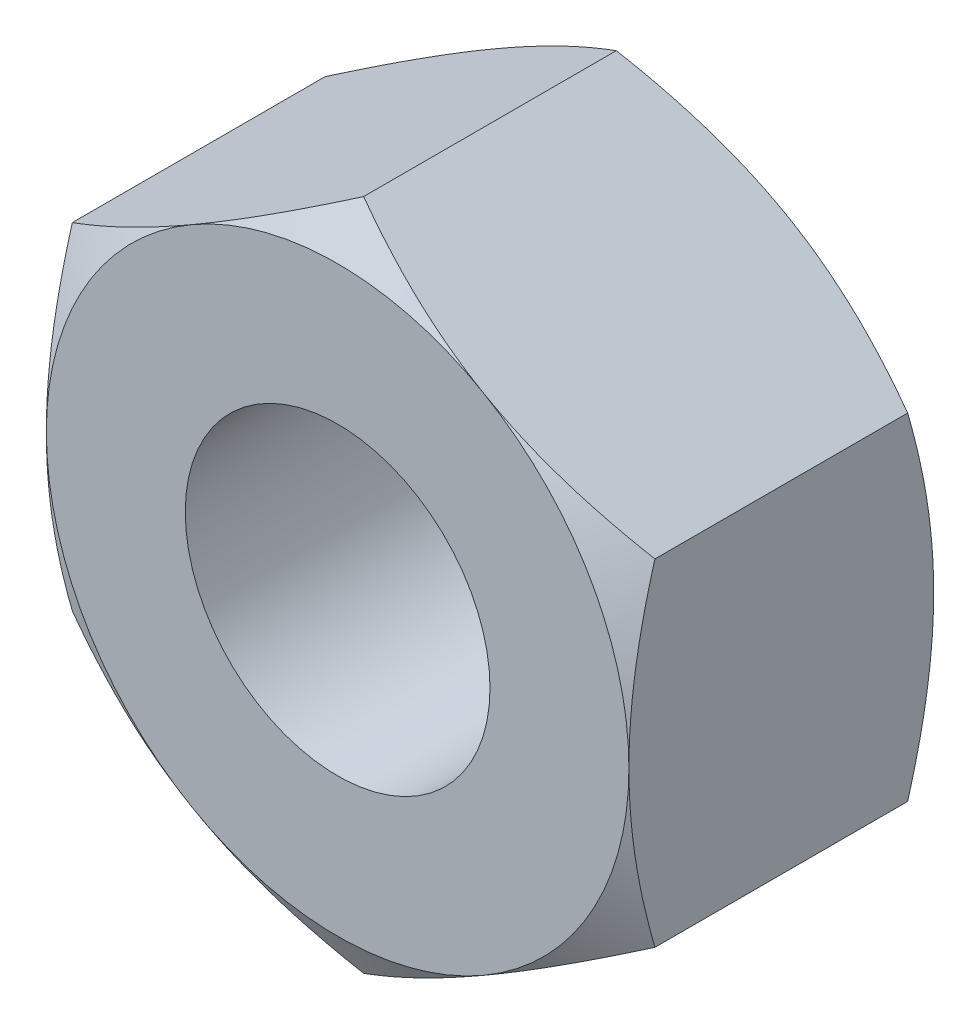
ISO-10303-21;
HEADER;
FILE_DESCRIPTION(('STEP AP214'),'2;1');
FILE_NAME('part.step','',(''),(''),'','','');
FILE_SCHEMA(('AUTOMOTIVE_DESIGN { 1 0 10303 214 1 1 1 1 }'));
ENDSEC;
DATA;
#1=APPLICATION_CONTEXT('core data for automotive mechanical design processes');
#2=APPLICATION_PROTOCOL_DEFINITION('international standard','automotive_design',2000,#1);
#3=PRODUCT_CONTEXT('',#1,'mechanical');
#4=PRODUCT('Part','Part','',(#3));
#5=PRODUCT_RELATED_PRODUCT_CATEGORY('part','',(#4));
#6=PRODUCT_DEFINITION_FORMATION('','',#4);
#7=PRODUCT_DEFINITION_CONTEXT('part definition',#1,'design');
#8=PRODUCT_DEFINITION('design','',#6,#7);
#9=PRODUCT_DEFINITION_SHAPE('','',#8);
#10=(LENGTH_UNIT() NAMED_UNIT(*) SI_UNIT(.MILLI.,.METRE.));
#11=(NAMED_UNIT(*) PLANE_ANGLE_UNIT() SI_UNIT($,.RADIAN.));
#12=(NAMED_UNIT(*) SI_UNIT($,.STERADIAN.) SOLID_ANGLE_UNIT());
#13=UNCERTAINTY_MEASURE_WITH_UNIT(LENGTH_MEASURE(1.E-05),#10,'distance_accuracy_value','');
#14=(GEOMETRIC_REPRESENTATION_CONTEXT(3) GLOBAL_UNCERTAINTY_ASSIGNED_CONTEXT((#13)) GLOBAL_UNIT_ASSIGNED_CONTEXT((#10,
#11,#12)) REPRESENTATION_CONTEXT('',''));
#15=CARTESIAN_POINT('',(0.,0.,0.));
#16=DIRECTION('',(0.,0.,1.));
#17=DIRECTION('',(1.,0.,0.));
#18=AXIS2_PLACEMENT_3D('',#15,#16,#17);
#19=CARTESIAN_POINT('',(0.,0.,-3.4));
#20=DIRECTION('',(0.,0.,1.));
#21=DIRECTION('',(1.,0.,0.));
#22=AXIS2_PLACEMENT_3D('',#19,#20,#21);
#23=PLANE('',#22);
#24=CARTESIAN_POINT('',(0.,0.,-3.4));
#25=DIRECTION('',(0.,0.,-1.));
#26=DIRECTION('',(-1.,0.,0.));
#27=AXIS2_PLACEMENT_3D('',#24,#25,#26);
#28=CIRCLE('',#27,3.4);
#29=CARTESIAN_POINT('',(-3.4,0.,-3.4));
#30=VERTEX_POINT('',#29);
#31=EDGE_CURVE('E218',#30,#30,#28,.T.);
#32=ORIENTED_EDGE('',*,*,#31,.F.);
#33=EDGE_LOOP('',(#32));
#34=FACE_BOUND('',#33,.T.);
#35=CARTESIAN_POINT('',(0.,0.,-3.4));
#36=DIRECTION('',(0.,0.,1.));
#37=DIRECTION('',(1.,0.,0.));
#38=AXIS2_PLACEMENT_3D('',#35,#36,#37);
#39=CIRCLE('',#38,6.50000000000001);
#40=CARTESIAN_POINT('',(3.25,5.62916512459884,-3.40000000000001));
#41=VERTEX_POINT('',#40);
#42=CARTESIAN_POINT('',(6.49999999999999,0.,-3.40000000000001));
#43=VERTEX_POINT('',#42);
#44=EDGE_CURVE('E43',#41,#43,#39,.F.);
#45=ORIENTED_EDGE('',*,*,#44,.T.);
#46=CARTESIAN_POINT('',(3.25,-5.62916512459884,-3.40000000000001));
#47=VERTEX_POINT('',#46);
#48=EDGE_CURVE('E11',#43,#47,#39,.F.);
#49=ORIENTED_EDGE('',*,*,#48,.T.);
#50=CARTESIAN_POINT('',(-3.24999999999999,-5.62916512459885,-3.4));
#51=VERTEX_POINT('',#50);
#52=EDGE_CURVE('E49',#47,#51,#39,.F.);
#53=ORIENTED_EDGE('',*,*,#52,.T.);
#54=CARTESIAN_POINT('',(-6.5,0.,-3.4));
#55=VERTEX_POINT('',#54);
#56=EDGE_CURVE('E133',#51,#55,#39,.F.);
#57=ORIENTED_EDGE('',*,*,#56,.T.);
#58=CARTESIAN_POINT('',(0.,0.,-3.40000000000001));
#59=DIRECTION('',(0.,0.,-1.));
#60=DIRECTION('',(-1.,0.,0.));
#61=AXIS2_PLACEMENT_3D('',#58,#59,#60);
#62=CIRCLE('',#61,6.5);
#63=CARTESIAN_POINT('',(-3.24999999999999,5.62916512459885,-3.4));
#64=VERTEX_POINT('',#63);
#65=EDGE_CURVE('E146',#55,#64,#62,.T.);
#66=ORIENTED_EDGE('',*,*,#65,.T.);
#67=EDGE_CURVE('E160',#64,#41,#39,.F.);
#68=ORIENTED_EDGE('',*,*,#67,.T.);
#69=EDGE_LOOP('',(#45,#49,#53,#57,#66,#68));
#70=FACE_BOUND('',#69,.T.);
#71=ADVANCED_FACE('F38',(#34,#70),#23,.F.);
#72=CARTESIAN_POINT('',(0.,0.,3.4));
#73=DIRECTION('',(0.,0.,1.));
#74=DIRECTION('',(1.,0.,0.));
#75=AXIS2_PLACEMENT_3D('',#72,#73,#74);
#76=PLANE('',#75);
#77=CARTESIAN_POINT('',(0.,0.,3.4));
#78=DIRECTION('',(0.,0.,-1.));
#79=DIRECTION('',(-1.,0.,0.));
#80=AXIS2_PLACEMENT_3D('',#77,#78,#79);
#81=CIRCLE('',#80,3.4);
#82=CARTESIAN_POINT('',(-3.4,0.,3.4));
#83=VERTEX_POINT('',#82);
#84=EDGE_CURVE('E294',#83,#83,#81,.T.);
#85=ORIENTED_EDGE('',*,*,#84,.T.);
#86=EDGE_LOOP('',(#85));
#87=FACE_BOUND('',#86,.T.);
#88=CARTESIAN_POINT('',(0.,0.,3.4));
#89=DIRECTION('',(0.,0.,1.));
#90=DIRECTION('',(1.,0.,0.));
#91=AXIS2_PLACEMENT_3D('',#88,#89,#90);
#92=CIRCLE('',#91,6.50000000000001);
#93=CARTESIAN_POINT('',(6.49999999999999,0.,3.40000000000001));
#94=VERTEX_POINT('',#93);
#95=CARTESIAN_POINT('',(3.25,-5.62916512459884,3.40000000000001));
#96=VERTEX_POINT('',#95);
#97=EDGE_CURVE('E325',#94,#96,#92,.F.);
#98=ORIENTED_EDGE('',*,*,#97,.F.);
#99=CARTESIAN_POINT('',(3.25,5.62916512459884,3.40000000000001));
#100=VERTEX_POINT('',#99);
#101=EDGE_CURVE('E321',#100,#94,#92,.F.);
#102=ORIENTED_EDGE('',*,*,#101,.F.);
#103=CARTESIAN_POINT('',(-3.24999999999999,5.62916512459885,3.4));
#104=VERTEX_POINT('',#103);
#105=EDGE_CURVE('E324',#104,#100,#92,.F.);
#106=ORIENTED_EDGE('',*,*,#105,.F.);
#107=CARTESIAN_POINT('',(0.,0.,3.40000000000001));
#108=DIRECTION('',(0.,0.,-1.));
#109=DIRECTION('',(-1.,0.,0.));
#110=AXIS2_PLACEMENT_3D('',#107,#108,#109);
#111=CIRCLE('',#110,6.5);
#112=CARTESIAN_POINT('',(-6.5,0.,3.4));
#113=VERTEX_POINT('',#112);
#114=EDGE_CURVE('E285',#113,#104,#111,.T.);
#115=ORIENTED_EDGE('',*,*,#114,.F.);
#116=CARTESIAN_POINT('',(-3.24999999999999,-5.62916512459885,3.4));
#117=VERTEX_POINT('',#116);
#118=EDGE_CURVE('E333',#117,#113,#92,.F.);
#119=ORIENTED_EDGE('',*,*,#118,.F.);
#120=EDGE_CURVE('E336',#96,#117,#92,.F.);
#121=ORIENTED_EDGE('',*,*,#120,.F.);
#122=EDGE_LOOP('',(#98,#102,#106,#115,#119,#121));
#123=FACE_BOUND('',#122,.T.);
#124=ADVANCED_FACE('F345',(#87,#123),#76,.T.);
#125=CARTESIAN_POINT('',(6.5,3.75277674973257,3.4));
#126=DIRECTION('',(-0.5,-0.866025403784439,0.));
#127=DIRECTION('',(0.866025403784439,-0.5,0.));
#128=AXIS2_PLACEMENT_3D('',#125,#126,#127);
#129=PLANE('',#128);
#130=DIRECTION('',(0.,0.,-1.));
#131=VECTOR('',#130,1.);
#132=CARTESIAN_POINT('',(6.5,3.75277674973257,3.4));
#133=LINE('',#132,#131);
#134=CARTESIAN_POINT('',(6.5,3.75277674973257,2.81944341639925));
#135=VERTEX_POINT('',#134);
#136=CARTESIAN_POINT('',(6.5,3.75277674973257,-2.81944341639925));
#137=VERTEX_POINT('',#136);
#138=EDGE_CURVE('E301',#135,#137,#133,.T.);
#139=ORIENTED_EDGE('',*,*,#138,.T.);
#140=CARTESIAN_POINT('',(6.5002,3.75266127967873,-2.81937674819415));
#141=CARTESIAN_POINT('',(6.35732254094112,3.8351516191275,-2.86699557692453));
#142=CARTESIAN_POINT('',(6.21391236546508,3.91794952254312,-2.91245329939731));
#143=CARTESIAN_POINT('',(5.9259273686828,4.08421773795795,-2.99845131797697));
#144=CARTESIAN_POINT('',(5.78135207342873,4.16768832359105,-3.03898949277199));
#145=CARTESIAN_POINT('',(5.34531134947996,4.41943655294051,-3.1524289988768));
#146=CARTESIAN_POINT('',(5.05212471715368,4.5887079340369,-3.21695219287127));
#147=CARTESIAN_POINT('',(4.61337625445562,4.84201947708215,-3.29261341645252));
#148=CARTESIAN_POINT('',(4.46912536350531,4.92530276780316,-3.31416714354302));
#149=CARTESIAN_POINT('',(4.17997178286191,5.09224566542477,-3.35030968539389));
#150=CARTESIAN_POINT('',(4.03506915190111,5.17590523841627,-3.36489911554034));
#151=CARTESIAN_POINT('',(3.74501222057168,5.34336968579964,-3.38674124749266));
#152=CARTESIAN_POINT('',(3.59985839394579,5.427174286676,-3.3940022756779));
#153=CARTESIAN_POINT('',(3.30942466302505,5.59485627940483,-3.40103969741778));
#154=CARTESIAN_POINT('',(3.16414476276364,5.6787336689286,-3.4008163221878));
#155=CARTESIAN_POINT('',(2.76612405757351,5.90853103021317,-3.38991654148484));
#156=CARTESIAN_POINT('',(2.51351353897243,6.05437578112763,-3.37161818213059));
#157=CARTESIAN_POINT('',(2.00997032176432,6.34509659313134,-3.31359365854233));
#158=CARTESIAN_POINT('',(1.75903939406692,6.48997163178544,-3.27384766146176));
#159=CARTESIAN_POINT('',(1.25448277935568,6.78127752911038,-3.17449409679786));
#160=CARTESIAN_POINT('',(1.00092075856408,6.92767163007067,-3.11446557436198));
#161=CARTESIAN_POINT('',(0.497578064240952,7.21827667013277,-2.97822500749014));
#162=CARTESIAN_POINT('',(0.247790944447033,7.36249133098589,-2.90204496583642));
#163=CARTESIAN_POINT('',(-0.000200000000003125,7.50566896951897,-2.81937674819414));
#164=B_SPLINE_CURVE_WITH_KNOTS('',3,(#140,#141,#142,#143,#144,#145,#146,#147,#148,#149,#150,
#151,#152,#153,#154,#155,#156,#157,#158,#159,#160,#161,#162,#163),.UNSPECIFIED.,.F.,.F.,(4,2,2,
2,2,2,2,2,2,2,2,4),(0.,0.515105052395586,1.03043143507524,2.06322554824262,2.56697389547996,
3.07067772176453,3.57380860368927,4.07692394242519,4.9527935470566,5.82947446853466,
6.72559912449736,7.61996451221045),.UNSPECIFIED.);
#165=EDGE_CURVE('E61',#137,#41,#164,.T.);
#166=ORIENTED_EDGE('',*,*,#165,.T.);
#167=CARTESIAN_POINT('',(0.,7.50555349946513,-2.81944341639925));
#168=VERTEX_POINT('',#167);
#169=EDGE_CURVE('E350',#41,#168,#164,.T.);
#170=ORIENTED_EDGE('',*,*,#169,.T.);
#171=DIRECTION('',(0.,0.,-1.));
#172=VECTOR('',#171,1.);
#173=CARTESIAN_POINT('',(0.,7.50555349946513,3.4));
#174=LINE('',#173,#172);
#175=CARTESIAN_POINT('',(0.,7.50555349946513,2.81944341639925));
#176=VERTEX_POINT('',#175);
#177=EDGE_CURVE('E319',#176,#168,#174,.T.);
#178=ORIENTED_EDGE('',*,*,#177,.F.);
#179=CARTESIAN_POINT('',(-0.000200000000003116,7.50566896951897,2.81937674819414));
#180=CARTESIAN_POINT('',(0.142677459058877,7.4231786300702,2.86699557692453));
#181=CARTESIAN_POINT('',(0.286087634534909,7.34038072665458,2.9124532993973));
#182=CARTESIAN_POINT('',(0.57407263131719,7.17411251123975,2.99845131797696));
#183=CARTESIAN_POINT('',(0.71864792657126,7.09064192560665,3.03898949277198));
#184=CARTESIAN_POINT('',(1.15468865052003,6.83889369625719,3.1524289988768));
#185=CARTESIAN_POINT('',(1.44787528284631,6.66962231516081,3.21695219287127));
#186=CARTESIAN_POINT('',(1.88662374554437,6.41631077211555,3.29261341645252));
#187=CARTESIAN_POINT('',(2.03087463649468,6.33302748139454,3.31416714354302));
#188=CARTESIAN_POINT('',(2.32002821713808,6.16608458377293,3.35030968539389));
#189=CARTESIAN_POINT('',(2.46493084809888,6.08242501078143,3.36489911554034));
#190=CARTESIAN_POINT('',(2.75498777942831,5.91496056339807,3.38674124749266));
#191=CARTESIAN_POINT('',(2.9001416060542,5.83115596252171,3.3940022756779));
#192=CARTESIAN_POINT('',(3.19057533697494,5.66347396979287,3.40103969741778));
#193=CARTESIAN_POINT('',(3.33585523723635,5.5795965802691,3.4008163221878));
#194=CARTESIAN_POINT('',(3.73387594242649,5.34979921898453,3.38991654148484));
#195=CARTESIAN_POINT('',(3.98648646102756,5.20395446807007,3.37161818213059));
#196=CARTESIAN_POINT('',(4.49002967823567,4.91323365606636,3.31359365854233));
#197=CARTESIAN_POINT('',(4.74096060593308,4.76835861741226,3.27384766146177));
#198=CARTESIAN_POINT('',(5.24551722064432,4.47705272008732,3.17449409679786));
#199=CARTESIAN_POINT('',(5.49907924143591,4.33065861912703,3.11446557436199));
#200=CARTESIAN_POINT('',(6.00242193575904,4.04005357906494,2.97822500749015));
#201=CARTESIAN_POINT('',(6.25220905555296,3.89583891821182,2.90204496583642));
#202=CARTESIAN_POINT('',(6.5002,3.75266127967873,2.81937674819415));
#203=B_SPLINE_CURVE_WITH_KNOTS('',3,(#179,#180,#181,#182,#183,#184,#185,#186,#187,#188,#189,
#190,#191,#192,#193,#194,#195,#196,#197,#198,#199,#200,#201,#202),.UNSPECIFIED.,.F.,.F.,(4,2,2,
2,2,2,2,2,2,2,2,4),(0.,0.515105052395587,1.03043143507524,2.06322554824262,2.56697389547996,
3.07067772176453,3.57380860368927,4.07692394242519,4.95279354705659,5.82947446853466,
6.72559912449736,7.61996451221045),.UNSPECIFIED.);
#204=EDGE_CURVE('E272',#176,#100,#203,.T.);
#205=ORIENTED_EDGE('',*,*,#204,.T.);
#206=EDGE_CURVE('E250',#100,#135,#203,.T.);
#207=ORIENTED_EDGE('',*,*,#206,.T.);
#208=EDGE_LOOP('',(#139,#166,#170,#178,#205,#207));
#209=FACE_BOUND('',#208,.T.);
#210=ADVANCED_FACE('F40',(#209),#129,.F.);
#211=CARTESIAN_POINT('',(0.,7.50555349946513,3.4));
#212=DIRECTION('',(0.5,-0.866025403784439,0.));
#213=DIRECTION('',(0.866025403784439,0.5,0.));
#214=AXIS2_PLACEMENT_3D('',#211,#212,#213);
#215=PLANE('',#214);
#216=ORIENTED_EDGE('',*,*,#177,.T.);
#217=CARTESIAN_POINT('',(0.000199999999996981,7.50566896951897,-2.81937674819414));
#218=CARTESIAN_POINT('',(-0.142677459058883,7.4231786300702,-2.86699557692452));
#219=CARTESIAN_POINT('',(-0.286087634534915,7.34038072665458,-2.9124532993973));
#220=CARTESIAN_POINT('',(-0.574072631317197,7.17411251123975,-2.99845131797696));
#221=CARTESIAN_POINT('',(-0.718647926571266,7.09064192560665,-3.03898949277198));
#222=CARTESIAN_POINT('',(-1.15468865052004,6.83889369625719,-3.1524289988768));
#223=CARTESIAN_POINT('',(-1.44787528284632,6.66962231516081,-3.21695219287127));
#224=CARTESIAN_POINT('',(-1.88662374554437,6.41631077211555,-3.29261341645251));
#225=CARTESIAN_POINT('',(-2.03087463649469,6.33302748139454,-3.31416714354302));
#226=CARTESIAN_POINT('',(-2.32002821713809,6.16608458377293,-3.35030968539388));
#227=CARTESIAN_POINT('',(-2.46493084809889,6.08242501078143,-3.36489911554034));
#228=CARTESIAN_POINT('',(-2.75498777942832,5.91496056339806,-3.38674124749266));
#229=CARTESIAN_POINT('',(-2.90014160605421,5.8311559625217,-3.39400227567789));
#230=CARTESIAN_POINT('',(-3.19057533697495,5.66347396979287,-3.40103969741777));
#231=CARTESIAN_POINT('',(-3.33585523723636,5.5795965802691,-3.4008163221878));
#232=CARTESIAN_POINT('',(-3.73387594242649,5.34979921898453,-3.38991654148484));
#233=CARTESIAN_POINT('',(-3.98648646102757,5.20395446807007,-3.37161818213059));
#234=CARTESIAN_POINT('',(-4.49002967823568,4.91323365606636,-3.31359365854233));
#235=CARTESIAN_POINT('',(-4.74096060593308,4.76835861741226,-3.27384766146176));
#236=CARTESIAN_POINT('',(-5.24551722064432,4.47705272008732,-3.17449409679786));
#237=CARTESIAN_POINT('',(-5.49907924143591,4.33065861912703,-3.11446557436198));
#238=CARTESIAN_POINT('',(-6.00242193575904,4.04005357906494,-2.97822500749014));
#239=CARTESIAN_POINT('',(-6.25220905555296,3.89583891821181,-2.90204496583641));
#240=CARTESIAN_POINT('',(-6.5002,3.75266127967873,-2.81937674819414));
#241=B_SPLINE_CURVE_WITH_KNOTS('',3,(#217,#218,#219,#220,#221,#222,#223,#224,#225,#226,#227,
#228,#229,#230,#231,#232,#233,#234,#235,#236,#237,#238,#239,#240),.UNSPECIFIED.,.F.,.F.,(4,2,2,
2,2,2,2,2,2,2,2,4),(0.,0.515105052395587,1.03043143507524,2.06322554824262,2.56697389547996,
3.07067772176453,3.57380860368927,4.07692394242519,4.95279354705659,5.82947446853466,
6.72559912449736,7.61996451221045),.UNSPECIFIED.);
#242=EDGE_CURVE('E170',#168,#64,#241,.T.);
#243=ORIENTED_EDGE('',*,*,#242,.T.);
#244=CARTESIAN_POINT('',(-6.5,3.75277674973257,-2.81944341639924));
#245=VERTEX_POINT('',#244);
#246=EDGE_CURVE('E149',#64,#245,#241,.T.);
#247=ORIENTED_EDGE('',*,*,#246,.T.);
#248=DIRECTION('',(0.,0.,-1.));
#249=VECTOR('',#248,1.);
#250=CARTESIAN_POINT('',(-6.5,3.75277674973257,3.4));
#251=LINE('',#250,#249);
#252=CARTESIAN_POINT('',(-6.5,3.75277674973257,2.81944341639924));
#253=VERTEX_POINT('',#252);
#254=EDGE_CURVE('E165',#253,#245,#251,.T.);
#255=ORIENTED_EDGE('',*,*,#254,.F.);
#256=CARTESIAN_POINT('',(-6.5002,3.75266127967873,2.81937674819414));
#257=CARTESIAN_POINT('',(-6.35732254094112,3.8351516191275,2.86699557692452));
#258=CARTESIAN_POINT('',(-6.21391236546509,3.91794952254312,2.9124532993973));
#259=CARTESIAN_POINT('',(-5.92592736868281,4.08421773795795,2.99845131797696));
#260=CARTESIAN_POINT('',(-5.78135207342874,4.16768832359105,3.03898949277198));
#261=CARTESIAN_POINT('',(-5.34531134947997,4.41943655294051,3.15242899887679));
#262=CARTESIAN_POINT('',(-5.05212471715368,4.58870793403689,3.21695219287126));
#263=CARTESIAN_POINT('',(-4.61337625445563,4.84201947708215,3.29261341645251));
#264=CARTESIAN_POINT('',(-4.46912536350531,4.92530276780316,3.31416714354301));
#265=CARTESIAN_POINT('',(-4.17997178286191,5.09224566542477,3.35030968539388));
#266=CARTESIAN_POINT('',(-4.03506915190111,5.17590523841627,3.36489911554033));
#267=CARTESIAN_POINT('',(-3.74501222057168,5.34336968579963,3.38674124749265));
#268=CARTESIAN_POINT('',(-3.59985839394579,5.427174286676,3.39400227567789));
#269=CARTESIAN_POINT('',(-3.30942466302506,5.59485627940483,3.40103969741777));
#270=CARTESIAN_POINT('',(-3.16414476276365,5.6787336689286,3.4008163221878));
#271=CARTESIAN_POINT('',(-2.76612405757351,5.90853103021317,3.38991654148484));
#272=CARTESIAN_POINT('',(-2.51351353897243,6.05437578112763,3.37161818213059));
#273=CARTESIAN_POINT('',(-2.00997032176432,6.34509659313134,3.31359365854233));
#274=CARTESIAN_POINT('',(-1.75903939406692,6.48997163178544,3.27384766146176));
#275=CARTESIAN_POINT('',(-1.25448277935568,6.78127752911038,3.17449409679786));
#276=CARTESIAN_POINT('',(-1.00092075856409,6.92767163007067,3.11446557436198));
#277=CARTESIAN_POINT('',(-0.497578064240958,7.21827667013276,2.97822500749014));
#278=CARTESIAN_POINT('',(-0.247790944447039,7.36249133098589,2.90204496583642));
#279=CARTESIAN_POINT('',(0.000199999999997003,7.50566896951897,2.81937674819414));
#280=B_SPLINE_CURVE_WITH_KNOTS('',3,(#256,#257,#258,#259,#260,#261,#262,#263,#264,#265,#266,
#267,#268,#269,#270,#271,#272,#273,#274,#275,#276,#277,#278,#279),.UNSPECIFIED.,.F.,.F.,(4,2,2,
2,2,2,2,2,2,2,2,4),(0.,0.515105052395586,1.03043143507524,2.06322554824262,2.56697389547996,
3.07067772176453,3.57380860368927,4.07692394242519,4.95279354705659,5.82947446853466,
6.72559912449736,7.61996451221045),.UNSPECIFIED.);
#281=EDGE_CURVE('E270',#253,#104,#280,.T.);
#282=ORIENTED_EDGE('',*,*,#281,.T.);
#283=EDGE_CURVE('E212',#104,#176,#280,.T.);
#284=ORIENTED_EDGE('',*,*,#283,.T.);
#285=EDGE_LOOP('',(#216,#243,#247,#255,#282,#284));
#286=FACE_BOUND('',#285,.T.);
#287=ADVANCED_FACE('F197',(#286),#215,.F.);
#288=CARTESIAN_POINT('',(-6.5,3.75277674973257,3.4));
#289=DIRECTION('',(1.,0.,0.));
#290=DIRECTION('',(0.,1.,0.));
#291=AXIS2_PLACEMENT_3D('',#288,#289,#290);
#292=PLANE('',#291);
#293=ORIENTED_EDGE('',*,*,#254,.T.);
#294=CARTESIAN_POINT('',(-6.49999999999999,-10.1789375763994,-0.179954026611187));
#295=CARTESIAN_POINT('',(-6.5,-9.89420569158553,-0.318467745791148));
#296=CARTESIAN_POINT('',(-6.5,-9.60883068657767,-0.455681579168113));
#297=CARTESIAN_POINT('',(-6.5,-9.03645282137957,-0.726780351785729));
#298=CARTESIAN_POINT('',(-6.5,-8.74944972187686,-0.860664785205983));
#299=CARTESIAN_POINT('',(-6.5,-8.17204195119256,-1.12502831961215));
#300=CARTESIAN_POINT('',(-6.5,-7.88162732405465,-1.25548574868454));
#301=CARTESIAN_POINT('',(-6.5,-7.29852251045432,-1.51119217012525));
#302=CARTESIAN_POINT('',(-6.5,-7.00583242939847,-1.63644140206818));
#303=CARTESIAN_POINT('',(-6.5,-6.40787719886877,-1.88443844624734));
#304=CARTESIAN_POINT('',(-6.5,-6.10251879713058,-2.00696261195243));
#305=CARTESIAN_POINT('',(-6.5,-5.48826571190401,-2.24297412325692));
#306=CARTESIAN_POINT('',(-6.5,-5.17937064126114,-2.35646046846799));
#307=CARTESIAN_POINT('',(-6.5,-4.55810105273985,-2.57148930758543));
#308=CARTESIAN_POINT('',(-6.5,-4.24573469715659,-2.67305515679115));
#309=CARTESIAN_POINT('',(-6.5,-3.61651842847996,-2.86104798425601));
#310=CARTESIAN_POINT('',(-6.5,-3.29966992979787,-2.94747962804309));
#311=CARTESIAN_POINT('',(-6.5,-2.66311232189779,-3.10065763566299));
#312=CARTESIAN_POINT('',(-6.5,-2.34343030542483,-3.1675148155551));
#313=CARTESIAN_POINT('',(-6.5,-1.69994353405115,-3.27782511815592));
#314=CARTESIAN_POINT('',(-6.5,-1.3761392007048,-3.32128061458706));
#315=CARTESIAN_POINT('',(-6.5,-0.890787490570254,-3.36603156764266));
#316=CARTESIAN_POINT('',(-6.5,-0.730142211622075,-3.37753273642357));
#317=CARTESIAN_POINT('',(-6.5,-0.408501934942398,-3.39373224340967));
#318=CARTESIAN_POINT('',(-6.5,-0.247506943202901,-3.39843069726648));
#319=CARTESIAN_POINT('',(-6.5,0.074535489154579,-3.40090495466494));
#320=CARTESIAN_POINT('',(-6.5,0.235582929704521,-3.39868076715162));
#321=CARTESIAN_POINT('',(-6.5,0.557438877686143,-3.38736734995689));
#322=CARTESIAN_POINT('',(-6.5,0.718247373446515,-3.37827779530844));
#323=CARTESIAN_POINT('',(-6.5,1.10177794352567,-3.34860619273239));
#324=CARTESIAN_POINT('',(-6.5,1.32426592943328,-3.32493007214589));
#325=CARTESIAN_POINT('',(-6.5,1.76764426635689,-3.26570479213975));
#326=CARTESIAN_POINT('',(-6.5,1.98853440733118,-3.23015409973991));
#327=CARTESIAN_POINT('',(-6.5,2.64852612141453,-3.10757058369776));
#328=CARTESIAN_POINT('',(-6.5,3.08471460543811,-3.00462690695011));
#329=CARTESIAN_POINT('',(-6.5,3.73705039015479,-2.82542929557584));
#330=CARTESIAN_POINT('',(-6.5,3.95656319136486,-2.76071599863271));
#331=CARTESIAN_POINT('',(-6.5,4.39345862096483,-2.62439535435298));
#332=CARTESIAN_POINT('',(-6.5,4.61084123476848,-2.55278795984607));
#333=CARTESIAN_POINT('',(-6.5,5.043541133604,-2.40384227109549));
#334=CARTESIAN_POINT('',(-6.5,5.25885903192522,-2.32650574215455));
#335=CARTESIAN_POINT('',(-6.5,5.68769952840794,-2.16702886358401));
#336=CARTESIAN_POINT('',(-6.5,5.90122215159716,-2.08488858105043));
#337=CARTESIAN_POINT('',(-6.5,6.41993815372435,-1.87970551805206));
#338=CARTESIAN_POINT('',(-6.5,6.72428181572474,-1.75451809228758));
#339=CARTESIAN_POINT('',(-6.5,7.33024094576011,-1.49768583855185));
#340=CARTESIAN_POINT('',(-6.5,7.6318562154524,-1.36604054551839));
#341=CARTESIAN_POINT('',(-6.5,8.2328905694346,-1.09763542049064));
#342=CARTESIAN_POINT('',(-6.5,8.53230905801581,-0.960874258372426));
#343=CARTESIAN_POINT('',(-6.5,9.12925264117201,-0.683310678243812));
#344=CARTESIAN_POINT('',(-6.5,9.42677778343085,-0.542508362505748));
#345=CARTESIAN_POINT('',(-6.5,10.0206253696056,-0.257472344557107));
#346=CARTESIAN_POINT('',(-6.5,10.3169458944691,-0.113234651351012));
#347=CARTESIAN_POINT('',(-6.5,10.908276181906,0.177905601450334));
#348=CARTESIAN_POINT('',(-6.5,11.2032859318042,0.324808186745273));
#349=CARTESIAN_POINT('',(-6.5,12.0865820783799,0.768734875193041));
#350=CARTESIAN_POINT('',(-6.5,12.673227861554,1.0690226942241));
#351=CARTESIAN_POINT('',(-6.5,13.7914174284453,1.64871031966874));
#352=CARTESIAN_POINT('',(-6.5,14.3232283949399,1.92759713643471));
#353=CARTESIAN_POINT('',(-6.5,15.384885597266,2.48913587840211));
#354=CARTESIAN_POINT('',(-6.5,15.9147317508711,2.77178795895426));
#355=CARTESIAN_POINT('',(-6.5,16.9714418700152,3.33915853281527));
#356=CARTESIAN_POINT('',(-6.50000000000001,17.4983100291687,3.6238692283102));
#357=CARTESIAN_POINT('',(-6.50000000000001,18.5507985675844,4.19551215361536));
#358=CARTESIAN_POINT('',(-6.50000000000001,19.0764190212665,4.48244424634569));
#359=CARTESIAN_POINT('',(-6.50000000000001,19.6015850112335,4.77020015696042));
#360=B_SPLINE_CURVE_WITH_KNOTS('',3,(#294,#295,#296,#297,#298,#299,#300,#301,#302,#303,#304,
#305,#306,#307,#308,#309,#310,#311,#312,#313,#314,#315,#316,#317,#318,#319,#320,#321,#322,#323,
#324,#325,#326,#327,#328,#329,#330,#331,#332,#333,#334,#335,#336,#337,#338,#339,#340,#341,#342,
#343,#344,#345,#346,#347,#348,#349,#350,#351,#352,#353,#354,#355,#356,#357,#358,#359),
.UNSPECIFIED.,.F.,.F.,(4,2,2,2,2,2,2,2,2,2,2,2,2,2,2,2,2,2,2,2,2,2,2,2,2,2,2,2,2,2,2,2,4),(0.,
0.949918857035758,1.89998115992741,2.85505176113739,3.8100783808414,4.79703592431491,
5.78410256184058,6.76920180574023,7.753996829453,8.73310381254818,9.71211146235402,
10.1951587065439,10.6781977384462,11.1612361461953,11.6442974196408,12.3151530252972,
12.9860952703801,14.3286824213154,15.0151814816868,15.7016852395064,16.3879783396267,
17.0742618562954,18.0614141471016,19.0486376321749,20.0361196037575,21.0235766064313,
22.0122428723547,23.0009186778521,24.9779620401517,26.7794473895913,28.581007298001,
30.3776240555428,32.1741308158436),.UNSPECIFIED.);
#361=EDGE_CURVE('E142',#245,#55,#360,.F.);
#362=ORIENTED_EDGE('',*,*,#361,.T.);
#363=CARTESIAN_POINT('',(-6.5,-3.75277674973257,-2.81944341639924));
#364=VERTEX_POINT('',#363);
#365=EDGE_CURVE('E129',#55,#364,#360,.F.);
#366=ORIENTED_EDGE('',*,*,#365,.T.);
#367=DIRECTION('',(0.,0.,-1.));
#368=VECTOR('',#367,1.);
#369=CARTESIAN_POINT('',(-6.5,-3.75277674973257,3.4));
#370=LINE('',#369,#368);
#371=CARTESIAN_POINT('',(-6.5,-3.75277674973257,2.81944341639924));
#372=VERTEX_POINT('',#371);
#373=EDGE_CURVE('E288',#372,#364,#370,.T.);
#374=ORIENTED_EDGE('',*,*,#373,.F.);
#375=CARTESIAN_POINT('',(-6.49999999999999,-10.1789375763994,0.179954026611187));
#376=CARTESIAN_POINT('',(-6.5,-9.89420569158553,0.318467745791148));
#377=CARTESIAN_POINT('',(-6.5,-9.60883068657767,0.455681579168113));
#378=CARTESIAN_POINT('',(-6.5,-9.03645282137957,0.726780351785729));
#379=CARTESIAN_POINT('',(-6.5,-8.74944972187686,0.860664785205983));
#380=CARTESIAN_POINT('',(-6.5,-8.17204195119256,1.12502831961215));
#381=CARTESIAN_POINT('',(-6.5,-7.88162732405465,1.25548574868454));
#382=CARTESIAN_POINT('',(-6.5,-7.29852251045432,1.51119217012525));
#383=CARTESIAN_POINT('',(-6.5,-7.00583242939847,1.63644140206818));
#384=CARTESIAN_POINT('',(-6.5,-6.40787719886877,1.88443844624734));
#385=CARTESIAN_POINT('',(-6.5,-6.10251879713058,2.00696261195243));
#386=CARTESIAN_POINT('',(-6.5,-5.48826571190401,2.24297412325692));
#387=CARTESIAN_POINT('',(-6.5,-5.17937064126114,2.35646046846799));
#388=CARTESIAN_POINT('',(-6.5,-4.55810105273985,2.57148930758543));
#389=CARTESIAN_POINT('',(-6.5,-4.24573469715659,2.67305515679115));
#390=CARTESIAN_POINT('',(-6.5,-3.61651842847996,2.86104798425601));
#391=CARTESIAN_POINT('',(-6.5,-3.29966992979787,2.94747962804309));
#392=CARTESIAN_POINT('',(-6.5,-2.66311232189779,3.10065763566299));
#393=CARTESIAN_POINT('',(-6.5,-2.34343030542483,3.1675148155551));
#394=CARTESIAN_POINT('',(-6.5,-1.69994353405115,3.27782511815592));
#395=CARTESIAN_POINT('',(-6.5,-1.3761392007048,3.32128061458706));
#396=CARTESIAN_POINT('',(-6.5,-0.890787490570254,3.36603156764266));
#397=CARTESIAN_POINT('',(-6.5,-0.730142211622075,3.37753273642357));
#398=CARTESIAN_POINT('',(-6.5,-0.408501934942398,3.39373224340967));
#399=CARTESIAN_POINT('',(-6.5,-0.247506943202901,3.39843069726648));
#400=CARTESIAN_POINT('',(-6.5,0.074535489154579,3.40090495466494));
#401=CARTESIAN_POINT('',(-6.5,0.235582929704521,3.39868076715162));
#402=CARTESIAN_POINT('',(-6.5,0.557438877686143,3.38736734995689));
#403=CARTESIAN_POINT('',(-6.5,0.718247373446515,3.37827779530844));
#404=CARTESIAN_POINT('',(-6.5,1.10177794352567,3.34860619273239));
#405=CARTESIAN_POINT('',(-6.5,1.32426592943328,3.32493007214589));
#406=CARTESIAN_POINT('',(-6.5,1.76764426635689,3.26570479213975));
#407=CARTESIAN_POINT('',(-6.5,1.98853440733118,3.23015409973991));
#408=CARTESIAN_POINT('',(-6.5,2.64852612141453,3.10757058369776));
#409=CARTESIAN_POINT('',(-6.5,3.08471460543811,3.00462690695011));
#410=CARTESIAN_POINT('',(-6.5,3.73705039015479,2.82542929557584));
#411=CARTESIAN_POINT('',(-6.5,3.95656319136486,2.76071599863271));
#412=CARTESIAN_POINT('',(-6.5,4.39345862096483,2.62439535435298));
#413=CARTESIAN_POINT('',(-6.5,4.61084123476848,2.55278795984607));
#414=CARTESIAN_POINT('',(-6.5,5.043541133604,2.40384227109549));
#415=CARTESIAN_POINT('',(-6.5,5.25885903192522,2.32650574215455));
#416=CARTESIAN_POINT('',(-6.5,5.68769952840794,2.16702886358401));
#417=CARTESIAN_POINT('',(-6.5,5.90122215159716,2.08488858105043));
#418=CARTESIAN_POINT('',(-6.5,6.41993815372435,1.87970551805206));
#419=CARTESIAN_POINT('',(-6.5,6.72428181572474,1.75451809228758));
#420=CARTESIAN_POINT('',(-6.5,7.33024094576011,1.49768583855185));
#421=CARTESIAN_POINT('',(-6.5,7.6318562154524,1.36604054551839));
#422=CARTESIAN_POINT('',(-6.5,8.2328905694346,1.09763542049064));
#423=CARTESIAN_POINT('',(-6.5,8.53230905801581,0.960874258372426));
#424=CARTESIAN_POINT('',(-6.5,9.12925264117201,0.683310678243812));
#425=CARTESIAN_POINT('',(-6.5,9.42677778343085,0.542508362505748));
#426=CARTESIAN_POINT('',(-6.5,10.0206253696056,0.257472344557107));
#427=CARTESIAN_POINT('',(-6.5,10.3169458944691,0.113234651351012));
#428=CARTESIAN_POINT('',(-6.5,10.908276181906,-0.177905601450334));
#429=CARTESIAN_POINT('',(-6.5,11.2032859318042,-0.324808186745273));
#430=CARTESIAN_POINT('',(-6.5,12.0865820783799,-0.768734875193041));
#431=CARTESIAN_POINT('',(-6.5,12.673227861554,-1.0690226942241));
#432=CARTESIAN_POINT('',(-6.5,13.7914174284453,-1.64871031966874));
#433=CARTESIAN_POINT('',(-6.5,14.3232283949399,-1.92759713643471));
#434=CARTESIAN_POINT('',(-6.5,15.384885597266,-2.48913587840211));
#435=CARTESIAN_POINT('',(-6.5,15.9147317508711,-2.77178795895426));
#436=CARTESIAN_POINT('',(-6.5,16.9714418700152,-3.33915853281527));
#437=CARTESIAN_POINT('',(-6.50000000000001,17.4983100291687,-3.6238692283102));
#438=CARTESIAN_POINT('',(-6.50000000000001,18.5507985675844,-4.19551215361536));
#439=CARTESIAN_POINT('',(-6.50000000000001,19.0764190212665,-4.48244424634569));
#440=CARTESIAN_POINT('',(-6.50000000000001,19.6015850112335,-4.77020015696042));
#441=B_SPLINE_CURVE_WITH_KNOTS('',3,(#375,#376,#377,#378,#379,#380,#381,#382,#383,#384,#385,
#386,#387,#388,#389,#390,#391,#392,#393,#394,#395,#396,#397,#398,#399,#400,#401,#402,#403,#404,
#405,#406,#407,#408,#409,#410,#411,#412,#413,#414,#415,#416,#417,#418,#419,#420,#421,#422,#423,
#424,#425,#426,#427,#428,#429,#430,#431,#432,#433,#434,#435,#436,#437,#438,#439,#440),
.UNSPECIFIED.,.F.,.F.,(4,2,2,2,2,2,2,2,2,2,2,2,2,2,2,2,2,2,2,2,2,2,2,2,2,2,2,2,2,2,2,2,4),(0.,
0.949918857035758,1.89998115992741,2.85505176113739,3.8100783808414,4.79703592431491,
5.78410256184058,6.76920180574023,7.753996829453,8.73310381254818,9.71211146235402,
10.1951587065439,10.6781977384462,11.1612361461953,11.6442974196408,12.3151530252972,
12.9860952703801,14.3286824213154,15.0151814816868,15.7016852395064,16.3879783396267,
17.0742618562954,18.0614141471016,19.0486376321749,20.0361196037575,21.0235766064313,
22.0122428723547,23.0009186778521,24.9779620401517,26.7794473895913,28.581007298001,
30.3776240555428,32.1741308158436),.UNSPECIFIED.);
#442=EDGE_CURVE('E210',#372,#113,#441,.T.);
#443=ORIENTED_EDGE('',*,*,#442,.T.);
#444=EDGE_CURVE('E203',#113,#253,#441,.T.);
#445=ORIENTED_EDGE('',*,*,#444,.T.);
#446=EDGE_LOOP('',(#293,#362,#366,#374,#443,#445));
#447=FACE_BOUND('',#446,.T.);
#448=ADVANCED_FACE('F162',(#447),#292,.F.);
#449=CARTESIAN_POINT('',(-6.5,-3.75277674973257,3.4));
#450=DIRECTION('',(0.5,0.866025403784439,0.));
#451=DIRECTION('',(-0.866025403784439,0.5,0.));
#452=AXIS2_PLACEMENT_3D('',#449,#450,#451);
#453=PLANE('',#452);
#454=ORIENTED_EDGE('',*,*,#373,.T.);
#455=CARTESIAN_POINT('',(-6.5002,-3.75266127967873,-2.81937674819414));
#456=CARTESIAN_POINT('',(-6.35732254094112,-3.83515161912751,-2.86699557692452));
#457=CARTESIAN_POINT('',(-6.21391236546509,-3.91794952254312,-2.9124532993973));
#458=CARTESIAN_POINT('',(-5.9259273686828,-4.08421773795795,-2.99845131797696));
#459=CARTESIAN_POINT('',(-5.78135207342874,-4.16768832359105,-3.03898949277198));
#460=CARTESIAN_POINT('',(-5.34531134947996,-4.41943655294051,-3.1524289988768));
#461=CARTESIAN_POINT('',(-5.05212471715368,-4.58870793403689,-3.21695219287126));
#462=CARTESIAN_POINT('',(-4.61337625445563,-4.84201947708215,-3.29261341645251));
#463=CARTESIAN_POINT('',(-4.46912536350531,-4.92530276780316,-3.31416714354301));
#464=CARTESIAN_POINT('',(-4.17997178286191,-5.09224566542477,-3.35030968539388));
#465=CARTESIAN_POINT('',(-4.03506915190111,-5.17590523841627,-3.36489911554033));
#466=CARTESIAN_POINT('',(-3.74501222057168,-5.34336968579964,-3.38674124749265));
#467=CARTESIAN_POINT('',(-3.59985839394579,-5.427174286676,-3.39400227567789));
#468=CARTESIAN_POINT('',(-3.30942466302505,-5.59485627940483,-3.40103969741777));
#469=CARTESIAN_POINT('',(-3.16414476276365,-5.6787336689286,-3.4008163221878));
#470=CARTESIAN_POINT('',(-2.76612405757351,-5.90853103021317,-3.38991654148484));
#471=CARTESIAN_POINT('',(-2.51351353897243,-6.05437578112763,-3.37161818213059));
#472=CARTESIAN_POINT('',(-2.00997032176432,-6.34509659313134,-3.31359365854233));
#473=CARTESIAN_POINT('',(-1.75903939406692,-6.48997163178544,-3.27384766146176));
#474=CARTESIAN_POINT('',(-1.25448277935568,-6.78127752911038,-3.17449409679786));
#475=CARTESIAN_POINT('',(-1.00092075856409,-6.92767163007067,-3.11446557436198));
#476=CARTESIAN_POINT('',(-0.497578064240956,-7.21827667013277,-2.97822500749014));
#477=CARTESIAN_POINT('',(-0.247790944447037,-7.36249133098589,-2.90204496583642));
#478=CARTESIAN_POINT('',(0.000200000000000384,-7.50566896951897,-2.81937674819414));
#479=B_SPLINE_CURVE_WITH_KNOTS('',3,(#455,#456,#457,#458,#459,#460,#461,#462,#463,#464,#465,
#466,#467,#468,#469,#470,#471,#472,#473,#474,#475,#476,#477,#478),.UNSPECIFIED.,.F.,.F.,(4,2,2,
2,2,2,2,2,2,2,2,4),(0.,0.515105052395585,1.03043143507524,2.06322554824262,2.56697389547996,
3.07067772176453,3.57380860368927,4.07692394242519,4.95279354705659,5.82947446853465,
6.72559912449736,7.61996451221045),.UNSPECIFIED.);
#480=EDGE_CURVE('E136',#364,#51,#479,.T.);
#481=ORIENTED_EDGE('',*,*,#480,.T.);
#482=CARTESIAN_POINT('',(0.,-7.50555349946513,-2.81944341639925));
#483=VERTEX_POINT('',#482);
#484=EDGE_CURVE('E179',#51,#483,#479,.T.);
#485=ORIENTED_EDGE('',*,*,#484,.T.);
#486=DIRECTION('',(0.,0.,-1.));
#487=VECTOR('',#486,1.);
#488=CARTESIAN_POINT('',(0.,-7.50555349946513,3.4));
#489=LINE('',#488,#487);
#490=CARTESIAN_POINT('',(0.,-7.50555349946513,2.81944341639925));
#491=VERTEX_POINT('',#490);
#492=EDGE_CURVE('E313',#491,#483,#489,.T.);
#493=ORIENTED_EDGE('',*,*,#492,.F.);
#494=CARTESIAN_POINT('',(0.000200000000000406,-7.50566896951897,2.81937674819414));
#495=CARTESIAN_POINT('',(-0.14267745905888,-7.4231786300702,2.86699557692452));
#496=CARTESIAN_POINT('',(-0.286087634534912,-7.34038072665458,2.9124532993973));
#497=CARTESIAN_POINT('',(-0.574072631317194,-7.17411251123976,2.99845131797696));
#498=CARTESIAN_POINT('',(-0.718647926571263,-7.09064192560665,3.03898949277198));
#499=CARTESIAN_POINT('',(-1.15468865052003,-6.83889369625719,3.1524289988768));
#500=CARTESIAN_POINT('',(-1.44787528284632,-6.66962231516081,3.21695219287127));
#501=CARTESIAN_POINT('',(-1.88662374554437,-6.41631077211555,3.29261341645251));
#502=CARTESIAN_POINT('',(-2.03087463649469,-6.33302748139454,3.31416714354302));
#503=CARTESIAN_POINT('',(-2.32002821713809,-6.16608458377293,3.35030968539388));
#504=CARTESIAN_POINT('',(-2.46493084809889,-6.08242501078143,3.36489911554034));
#505=CARTESIAN_POINT('',(-2.75498777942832,-5.91496056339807,3.38674124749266));
#506=CARTESIAN_POINT('',(-2.90014160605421,-5.8311559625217,3.39400227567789));
#507=CARTESIAN_POINT('',(-3.19057533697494,-5.66347396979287,3.40103969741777));
#508=CARTESIAN_POINT('',(-3.33585523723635,-5.5795965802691,3.4008163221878));
#509=CARTESIAN_POINT('',(-3.73387594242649,-5.34979921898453,3.38991654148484));
#510=CARTESIAN_POINT('',(-3.98648646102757,-5.20395446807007,3.37161818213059));
#511=CARTESIAN_POINT('',(-4.49002967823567,-4.91323365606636,3.31359365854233));
#512=CARTESIAN_POINT('',(-4.74096060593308,-4.76835861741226,3.27384766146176));
#513=CARTESIAN_POINT('',(-5.24551722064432,-4.47705272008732,3.17449409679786));
#514=CARTESIAN_POINT('',(-5.49907924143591,-4.33065861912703,3.11446557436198));
#515=CARTESIAN_POINT('',(-6.00242193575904,-4.04005357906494,2.97822500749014));
#516=CARTESIAN_POINT('',(-6.25220905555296,-3.89583891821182,2.90204496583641));
#517=CARTESIAN_POINT('',(-6.5002,-3.75266127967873,2.81937674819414));
#518=B_SPLINE_CURVE_WITH_KNOTS('',3,(#494,#495,#496,#497,#498,#499,#500,#501,#502,#503,#504,
#505,#506,#507,#508,#509,#510,#511,#512,#513,#514,#515,#516,#517),.UNSPECIFIED.,.F.,.F.,(4,2,2,
2,2,2,2,2,2,2,2,4),(0.,0.515105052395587,1.03043143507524,2.06322554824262,2.56697389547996,
3.07067772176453,3.57380860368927,4.07692394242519,4.95279354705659,5.82947446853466,
6.72559912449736,7.61996451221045),.UNSPECIFIED.);
#519=EDGE_CURVE('E255',#491,#117,#518,.T.);
#520=ORIENTED_EDGE('',*,*,#519,.T.);
#521=EDGE_CURVE('E211',#117,#372,#518,.T.);
#522=ORIENTED_EDGE('',*,*,#521,.T.);
#523=EDGE_LOOP('',(#454,#481,#485,#493,#520,#522));
#524=FACE_BOUND('',#523,.T.);
#525=ADVANCED_FACE('F196',(#524),#453,.F.);
#526=CARTESIAN_POINT('',(0.,-7.50555349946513,3.4));
#527=DIRECTION('',(-0.5,0.866025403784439,0.));
#528=DIRECTION('',(-0.866025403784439,-0.5,0.));
#529=AXIS2_PLACEMENT_3D('',#526,#527,#528);
#530=PLANE('',#529);
#531=ORIENTED_EDGE('',*,*,#492,.T.);
#532=CARTESIAN_POINT('',(-0.000199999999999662,-7.50566896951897,-2.81937674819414));
#533=CARTESIAN_POINT('',(0.14267745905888,-7.4231786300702,-2.86699557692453));
#534=CARTESIAN_POINT('',(0.286087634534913,-7.34038072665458,-2.9124532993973));
#535=CARTESIAN_POINT('',(0.574072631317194,-7.17411251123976,-2.99845131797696));
#536=CARTESIAN_POINT('',(0.718647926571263,-7.09064192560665,-3.03898949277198));
#537=CARTESIAN_POINT('',(1.15468865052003,-6.83889369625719,-3.1524289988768));
#538=CARTESIAN_POINT('',(1.44787528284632,-6.66962231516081,-3.21695219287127));
#539=CARTESIAN_POINT('',(1.88662374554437,-6.41631077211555,-3.29261341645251));
#540=CARTESIAN_POINT('',(2.03087463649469,-6.33302748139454,-3.31416714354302));
#541=CARTESIAN_POINT('',(2.32002821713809,-6.16608458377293,-3.35030968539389));
#542=CARTESIAN_POINT('',(2.46493084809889,-6.08242501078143,-3.36489911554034));
#543=CARTESIAN_POINT('',(2.75498777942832,-5.91496056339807,-3.38674124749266));
#544=CARTESIAN_POINT('',(2.90014160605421,-5.8311559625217,-3.3940022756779));
#545=CARTESIAN_POINT('',(3.19057533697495,-5.66347396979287,-3.40103969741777));
#546=CARTESIAN_POINT('',(3.33585523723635,-5.5795965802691,-3.4008163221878));
#547=CARTESIAN_POINT('',(3.73387594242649,-5.34979921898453,-3.38991654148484));
#548=CARTESIAN_POINT('',(3.98648646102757,-5.20395446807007,-3.37161818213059));
#549=CARTESIAN_POINT('',(4.49002967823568,-4.91323365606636,-3.31359365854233));
#550=CARTESIAN_POINT('',(4.74096060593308,-4.76835861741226,-3.27384766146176));
#551=CARTESIAN_POINT('',(5.24551722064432,-4.47705272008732,-3.17449409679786));
#552=CARTESIAN_POINT('',(5.49907924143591,-4.33065861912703,-3.11446557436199));
#553=CARTESIAN_POINT('',(6.00242193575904,-4.04005357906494,-2.97822500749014));
#554=CARTESIAN_POINT('',(6.25220905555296,-3.89583891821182,-2.90204496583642));
#555=CARTESIAN_POINT('',(6.5002,-3.75266127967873,-2.81937674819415));
#556=B_SPLINE_CURVE_WITH_KNOTS('',3,(#532,#533,#534,#535,#536,#537,#538,#539,#540,#541,#542,
#543,#544,#545,#546,#547,#548,#549,#550,#551,#552,#553,#554,#555),.UNSPECIFIED.,.F.,.F.,(4,2,2,
2,2,2,2,2,2,2,2,4),(0.,0.515105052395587,1.03043143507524,2.06322554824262,2.56697389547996,
3.07067772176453,3.57380860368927,4.07692394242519,4.9527935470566,5.82947446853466,
6.72559912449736,7.61996451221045),.UNSPECIFIED.);
#557=EDGE_CURVE('E408',#483,#47,#556,.T.);
#558=ORIENTED_EDGE('',*,*,#557,.T.);
#559=CARTESIAN_POINT('',(6.5,-3.75277674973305,-2.81944341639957));
#560=VERTEX_POINT('',#559);
#561=EDGE_CURVE('E401',#47,#560,#556,.T.);
#562=ORIENTED_EDGE('',*,*,#561,.T.);
#563=DIRECTION('',(0.,0.,-1.));
#564=VECTOR('',#563,1.);
#565=CARTESIAN_POINT('',(6.5,-3.75277674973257,3.4));
#566=LINE('',#565,#564);
#567=CARTESIAN_POINT('',(6.5,-3.75277674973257,2.81944341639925));
#568=VERTEX_POINT('',#567);
#569=EDGE_CURVE('E307',#568,#560,#566,.T.);
#570=ORIENTED_EDGE('',*,*,#569,.F.);
#571=CARTESIAN_POINT('',(6.5002,-3.75266127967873,2.81937674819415));
#572=CARTESIAN_POINT('',(6.35732254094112,-3.8351516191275,2.86699557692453));
#573=CARTESIAN_POINT('',(6.21391236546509,-3.91794952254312,2.91245329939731));
#574=CARTESIAN_POINT('',(5.92592736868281,-4.08421773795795,2.99845131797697));
#575=CARTESIAN_POINT('',(5.78135207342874,-4.16768832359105,3.03898949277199));
#576=CARTESIAN_POINT('',(5.34531134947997,-4.41943655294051,3.1524289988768));
#577=CARTESIAN_POINT('',(5.05212471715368,-4.58870793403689,3.21695219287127));
#578=CARTESIAN_POINT('',(4.61337625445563,-4.84201947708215,3.29261341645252));
#579=CARTESIAN_POINT('',(4.46912536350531,-4.92530276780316,3.31416714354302));
#580=CARTESIAN_POINT('',(4.17997178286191,-5.09224566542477,3.35030968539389));
#581=CARTESIAN_POINT('',(4.03506915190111,-5.17590523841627,3.36489911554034));
#582=CARTESIAN_POINT('',(3.74501222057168,-5.34336968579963,3.38674124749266));
#583=CARTESIAN_POINT('',(3.59985839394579,-5.427174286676,3.3940022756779));
#584=CARTESIAN_POINT('',(3.30942466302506,-5.59485627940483,3.40103969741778));
#585=CARTESIAN_POINT('',(3.16414476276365,-5.6787336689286,3.4008163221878));
#586=CARTESIAN_POINT('',(2.76612405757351,-5.90853103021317,3.38991654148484));
#587=CARTESIAN_POINT('',(2.51351353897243,-6.05437578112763,3.37161818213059));
#588=CARTESIAN_POINT('',(2.00997032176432,-6.34509659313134,3.31359365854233));
#589=CARTESIAN_POINT('',(1.75903939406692,-6.48997163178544,3.27384766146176));
#590=CARTESIAN_POINT('',(1.25448277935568,-6.78127752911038,3.17449409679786));
#591=CARTESIAN_POINT('',(1.00092075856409,-6.92767163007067,3.11446557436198));
#592=CARTESIAN_POINT('',(0.497578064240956,-7.21827667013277,2.97822500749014));
#593=CARTESIAN_POINT('',(0.247790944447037,-7.36249133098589,2.90204496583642));
#594=CARTESIAN_POINT('',(-0.000199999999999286,-7.50566896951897,2.81937674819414));
#595=B_SPLINE_CURVE_WITH_KNOTS('',3,(#571,#572,#573,#574,#575,#576,#577,#578,#579,#580,#581,
#582,#583,#584,#585,#586,#587,#588,#589,#590,#591,#592,#593,#594),.UNSPECIFIED.,.F.,.F.,(4,2,2,
2,2,2,2,2,2,2,2,4),(0.,0.515105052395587,1.03043143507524,2.06322554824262,2.56697389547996,
3.07067772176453,3.57380860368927,4.07692394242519,4.9527935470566,5.82947446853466,
6.72559912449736,7.61996451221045),.UNSPECIFIED.);
#596=EDGE_CURVE('E243',#568,#96,#595,.T.);
#597=ORIENTED_EDGE('',*,*,#596,.T.);
#598=EDGE_CURVE('E262',#96,#491,#595,.T.);
#599=ORIENTED_EDGE('',*,*,#598,.T.);
#600=EDGE_LOOP('',(#531,#558,#562,#570,#597,#599));
#601=FACE_BOUND('',#600,.T.);
#602=ADVANCED_FACE('F392',(#601),#530,.F.);
#603=CARTESIAN_POINT('',(6.5,-3.75277674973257,3.4));
#604=DIRECTION('',(-1.,0.,0.));
#605=DIRECTION('',(0.,-1.,0.));
#606=AXIS2_PLACEMENT_3D('',#603,#604,#605);
#607=PLANE('',#606);
#608=ORIENTED_EDGE('',*,*,#569,.T.);
#609=CARTESIAN_POINT('',(6.5,-10.1789375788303,-0.179954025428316));
#610=CARTESIAN_POINT('',(6.5,-9.8942056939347,-0.318467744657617));
#611=CARTESIAN_POINT('',(6.5,-9.60883068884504,-0.455681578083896));
#612=CARTESIAN_POINT('',(6.5,-9.0364528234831,-0.726780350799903));
#613=CARTESIAN_POINT('',(6.5,-8.74944972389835,-0.860664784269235));
#614=CARTESIAN_POINT('',(6.5,-8.1720419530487,-1.12502831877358));
#615=CARTESIAN_POINT('',(6.5,-7.88162732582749,-1.25548574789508));
#616=CARTESIAN_POINT('',(6.5,-7.29852251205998,-1.51119216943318));
#617=CARTESIAN_POINT('',(6.5,-7.00583243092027,-1.6364414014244));
#618=CARTESIAN_POINT('',(6.5,-6.40787720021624,-1.88443844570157));
#619=CARTESIAN_POINT('',(6.5,-6.10251879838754,-2.00696261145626));
#620=CARTESIAN_POINT('',(6.5,-5.48826571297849,-2.24297412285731));
#621=CARTESIAN_POINT('',(6.5,-5.17937064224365,-2.35646046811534));
#622=CARTESIAN_POINT('',(6.5,-4.55810105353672,-2.57148930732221));
#623=CARTESIAN_POINT('',(6.5,-4.24573469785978,-2.67305515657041));
#624=CARTESIAN_POINT('',(6.5,-3.61651842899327,-2.8610479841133));
#625=CARTESIAN_POINT('',(6.5,-3.29966993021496,-2.94747962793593));
#626=CARTESIAN_POINT('',(6.5,-2.66311232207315,-3.10065763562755));
#627=CARTESIAN_POINT('',(6.5,-2.343430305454,-3.1675148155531));
#628=CARTESIAN_POINT('',(6.5,-1.69994353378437,-3.27782511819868));
#629=CARTESIAN_POINT('',(6.5,-1.37613920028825,-3.32128061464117));
#630=CARTESIAN_POINT('',(6.5,-0.890787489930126,-3.36603156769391));
#631=CARTESIAN_POINT('',(6.5,-0.730142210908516,-3.37753273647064));
#632=CARTESIAN_POINT('',(6.5,-0.408501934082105,-3.3937322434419));
#633=CARTESIAN_POINT('',(6.5,-0.247506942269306,-3.39843069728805));
#634=CARTESIAN_POINT('',(6.5,0.0745354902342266,-3.40090495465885));
#635=CARTESIAN_POINT('',(6.5,0.235582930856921,-3.39868076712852));
#636=CARTESIAN_POINT('',(6.5,0.557438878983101,-3.38736734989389));
#637=CARTESIAN_POINT('',(6.5,0.718247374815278,-3.37827779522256));
#638=CARTESIAN_POINT('',(6.5,1.10177794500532,-3.34860619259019));
#639=CARTESIAN_POINT('',(6.5,1.3242659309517,-3.32493007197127));
#640=CARTESIAN_POINT('',(6.5,1.76764426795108,-3.26570479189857));
#641=CARTESIAN_POINT('',(6.5,1.98853440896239,-3.23015409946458));
#642=CARTESIAN_POINT('',(6.5,2.64852612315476,-3.10757058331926));
#643=CARTESIAN_POINT('',(6.5,3.08471460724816,-3.00462690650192));
#644=CARTESIAN_POINT('',(6.5,3.73705039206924,-2.82542929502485));
#645=CARTESIAN_POINT('',(6.5,3.95656319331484,-2.76071599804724));
#646=CARTESIAN_POINT('',(6.5,4.39345862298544,-2.62439535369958));
#647=CARTESIAN_POINT('',(6.5,4.61084123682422,-2.55278795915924));
#648=CARTESIAN_POINT('',(6.5,5.04354113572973,-2.40384227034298));
#649=CARTESIAN_POINT('',(6.5,5.25885903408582,-2.3265057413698));
#650=CARTESIAN_POINT('',(6.5,5.68769953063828,-2.1670288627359));
#651=CARTESIAN_POINT('',(6.5,5.90122215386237,-2.08488858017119));
#652=CARTESIAN_POINT('',(6.5,6.41993815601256,-1.87970551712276));
#653=CARTESIAN_POINT('',(6.5,6.72428181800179,-1.75451809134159));
#654=CARTESIAN_POINT('',(6.5,7.33024094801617,-1.49768583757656));
#655=CARTESIAN_POINT('',(6.5,7.63185621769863,-1.3660405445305));
#656=CARTESIAN_POINT('',(6.5,8.23289057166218,-1.09763541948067));
#657=CARTESIAN_POINT('',(6.49999999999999,8.53230906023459,-0.960874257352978));
#658=CARTESIAN_POINT('',(6.49999999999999,9.12925264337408,-0.683310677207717));
#659=CARTESIAN_POINT('',(6.49999999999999,9.42677778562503,-0.542508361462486));
#660=CARTESIAN_POINT('',(6.49999999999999,10.0206253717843,-0.257472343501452));
#661=CARTESIAN_POINT('',(6.49999999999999,10.3169458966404,-0.113234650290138));
#662=CARTESIAN_POINT('',(6.49999999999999,10.9082761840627,0.177905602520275));
#663=CARTESIAN_POINT('',(6.49999999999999,11.203285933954,0.32480818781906));
#664=CARTESIAN_POINT('',(6.49999999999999,12.0865820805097,0.768734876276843));
#665=CARTESIAN_POINT('',(6.49999999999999,12.6732278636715,1.06902269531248));
#666=CARTESIAN_POINT('',(6.49999999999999,13.791417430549,1.64871032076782));
#667=CARTESIAN_POINT('',(6.49999999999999,14.3232283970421,1.92759713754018));
#668=CARTESIAN_POINT('',(6.49999999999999,15.3848855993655,2.48913587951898));
#669=CARTESIAN_POINT('',(6.49999999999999,15.9147317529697,2.77178796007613));
#670=CARTESIAN_POINT('',(6.49999999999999,16.9714418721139,3.33915853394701));
#671=CARTESIAN_POINT('',(6.49999999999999,17.4983100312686,3.62386922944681));
#672=CARTESIAN_POINT('',(6.49999999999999,18.5507985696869,4.19551215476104));
#673=CARTESIAN_POINT('',(6.49999999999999,19.0764190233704,4.48244424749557));
#674=CARTESIAN_POINT('',(6.49999999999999,19.601585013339,4.77020015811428));
#675=B_SPLINE_CURVE_WITH_KNOTS('',3,(#609,#610,#611,#612,#613,#614,#615,#616,#617,#618,#619,
#620,#621,#622,#623,#624,#625,#626,#627,#628,#629,#630,#631,#632,#633,#634,#635,#636,#637,#638,
#639,#640,#641,#642,#643,#644,#645,#646,#647,#648,#649,#650,#651,#652,#653,#654,#655,#656,#657,
#658,#659,#660,#661,#662,#663,#664,#665,#666,#667,#668,#669,#670,#671,#672,#673,#674),
.UNSPECIFIED.,.F.,.F.,(4,2,2,2,2,2,2,2,2,2,2,2,2,2,2,2,2,2,2,2,2,2,2,2,2,2,2,2,2,2,2,2,4),(0.,
0.949918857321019,1.89998116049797,2.85505176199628,3.81007838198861,4.79703592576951,
5.78410256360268,6.76920180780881,7.75399683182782,8.73310381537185,9.7121114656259,
10.1951587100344,10.6781977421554,11.1612361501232,11.6442974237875,12.3151530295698,
12.9860952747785,14.3286824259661,15.0151814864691,15.7016852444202,16.3879783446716,
17.0742618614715,18.0614141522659,19.0486376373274,20.0361196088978,21.0235766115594,
22.0122428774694,23.0009186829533,24.9779620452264,26.7794473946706,28.5810073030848,
30.3776240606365,32.1741308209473),.UNSPECIFIED.);
#676=EDGE_CURVE('E400',#560,#43,#675,.T.);
#677=ORIENTED_EDGE('',*,*,#676,.T.);
#678=EDGE_CURVE('E155',#43,#137,#675,.T.);
#679=ORIENTED_EDGE('',*,*,#678,.T.);
#680=ORIENTED_EDGE('',*,*,#138,.F.);
#681=CARTESIAN_POINT('',(6.5,-10.1789375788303,0.179954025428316));
#682=CARTESIAN_POINT('',(6.5,-9.8942056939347,0.318467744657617));
#683=CARTESIAN_POINT('',(6.5,-9.60883068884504,0.455681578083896));
#684=CARTESIAN_POINT('',(6.5,-9.0364528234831,0.726780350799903));
#685=CARTESIAN_POINT('',(6.5,-8.74944972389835,0.860664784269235));
#686=CARTESIAN_POINT('',(6.5,-8.1720419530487,1.12502831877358));
#687=CARTESIAN_POINT('',(6.5,-7.88162732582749,1.25548574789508));
#688=CARTESIAN_POINT('',(6.5,-7.29852251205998,1.51119216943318));
#689=CARTESIAN_POINT('',(6.5,-7.00583243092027,1.6364414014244));
#690=CARTESIAN_POINT('',(6.5,-6.40787720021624,1.88443844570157));
#691=CARTESIAN_POINT('',(6.5,-6.10251879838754,2.00696261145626));
#692=CARTESIAN_POINT('',(6.5,-5.48826571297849,2.24297412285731));
#693=CARTESIAN_POINT('',(6.5,-5.17937064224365,2.35646046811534));
#694=CARTESIAN_POINT('',(6.5,-4.55810105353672,2.57148930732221));
#695=CARTESIAN_POINT('',(6.5,-4.24573469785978,2.67305515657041));
#696=CARTESIAN_POINT('',(6.5,-3.61651842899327,2.8610479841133));
#697=CARTESIAN_POINT('',(6.5,-3.29966993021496,2.94747962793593));
#698=CARTESIAN_POINT('',(6.5,-2.66311232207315,3.10065763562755));
#699=CARTESIAN_POINT('',(6.5,-2.343430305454,3.1675148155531));
#700=CARTESIAN_POINT('',(6.5,-1.69994353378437,3.27782511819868));
#701=CARTESIAN_POINT('',(6.5,-1.37613920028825,3.32128061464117));
#702=CARTESIAN_POINT('',(6.5,-0.890787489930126,3.36603156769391));
#703=CARTESIAN_POINT('',(6.5,-0.730142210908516,3.37753273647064));
#704=CARTESIAN_POINT('',(6.5,-0.408501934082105,3.3937322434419));
#705=CARTESIAN_POINT('',(6.5,-0.247506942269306,3.39843069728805));
#706=CARTESIAN_POINT('',(6.5,0.0745354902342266,3.40090495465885));
#707=CARTESIAN_POINT('',(6.5,0.235582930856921,3.39868076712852));
#708=CARTESIAN_POINT('',(6.5,0.557438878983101,3.38736734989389));
#709=CARTESIAN_POINT('',(6.5,0.718247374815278,3.37827779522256));
#710=CARTESIAN_POINT('',(6.5,1.10177794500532,3.34860619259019));
#711=CARTESIAN_POINT('',(6.5,1.3242659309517,3.32493007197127));
#712=CARTESIAN_POINT('',(6.5,1.76764426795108,3.26570479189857));
#713=CARTESIAN_POINT('',(6.5,1.98853440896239,3.23015409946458));
#714=CARTESIAN_POINT('',(6.5,2.64852612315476,3.10757058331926));
#715=CARTESIAN_POINT('',(6.5,3.08471460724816,3.00462690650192));
#716=CARTESIAN_POINT('',(6.5,3.73705039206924,2.82542929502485));
#717=CARTESIAN_POINT('',(6.5,3.95656319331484,2.76071599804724));
#718=CARTESIAN_POINT('',(6.5,4.39345862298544,2.62439535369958));
#719=CARTESIAN_POINT('',(6.5,4.61084123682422,2.55278795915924));
#720=CARTESIAN_POINT('',(6.5,5.04354113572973,2.40384227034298));
#721=CARTESIAN_POINT('',(6.5,5.25885903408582,2.3265057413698));
#722=CARTESIAN_POINT('',(6.5,5.68769953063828,2.1670288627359));
#723=CARTESIAN_POINT('',(6.5,5.90122215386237,2.08488858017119));
#724=CARTESIAN_POINT('',(6.5,6.41993815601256,1.87970551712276));
#725=CARTESIAN_POINT('',(6.5,6.72428181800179,1.75451809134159));
#726=CARTESIAN_POINT('',(6.5,7.33024094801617,1.49768583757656));
#727=CARTESIAN_POINT('',(6.5,7.63185621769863,1.3660405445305));
#728=CARTESIAN_POINT('',(6.5,8.23289057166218,1.09763541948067));
#729=CARTESIAN_POINT('',(6.49999999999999,8.53230906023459,0.960874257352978));
#730=CARTESIAN_POINT('',(6.49999999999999,9.12925264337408,0.683310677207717));
#731=CARTESIAN_POINT('',(6.49999999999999,9.42677778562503,0.542508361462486));
#732=CARTESIAN_POINT('',(6.49999999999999,10.0206253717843,0.257472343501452));
#733=CARTESIAN_POINT('',(6.49999999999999,10.3169458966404,0.113234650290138));
#734=CARTESIAN_POINT('',(6.49999999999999,10.9082761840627,-0.177905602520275));
#735=CARTESIAN_POINT('',(6.49999999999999,11.203285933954,-0.32480818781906));
#736=CARTESIAN_POINT('',(6.49999999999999,12.0865820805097,-0.768734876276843));
#737=CARTESIAN_POINT('',(6.49999999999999,12.6732278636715,-1.06902269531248));
#738=CARTESIAN_POINT('',(6.49999999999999,13.791417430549,-1.64871032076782));
#739=CARTESIAN_POINT('',(6.49999999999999,14.3232283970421,-1.92759713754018));
#740=CARTESIAN_POINT('',(6.49999999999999,15.3848855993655,-2.48913587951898));
#741=CARTESIAN_POINT('',(6.49999999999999,15.9147317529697,-2.77178796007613));
#742=CARTESIAN_POINT('',(6.49999999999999,16.9714418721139,-3.33915853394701));
#743=CARTESIAN_POINT('',(6.49999999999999,17.4983100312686,-3.62386922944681));
#744=CARTESIAN_POINT('',(6.49999999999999,18.5507985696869,-4.19551215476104));
#745=CARTESIAN_POINT('',(6.49999999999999,19.0764190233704,-4.48244424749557));
#746=CARTESIAN_POINT('',(6.49999999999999,19.601585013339,-4.77020015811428));
#747=B_SPLINE_CURVE_WITH_KNOTS('',3,(#681,#682,#683,#684,#685,#686,#687,#688,#689,#690,#691,
#692,#693,#694,#695,#696,#697,#698,#699,#700,#701,#702,#703,#704,#705,#706,#707,#708,#709,#710,
#711,#712,#713,#714,#715,#716,#717,#718,#719,#720,#721,#722,#723,#724,#725,#726,#727,#728,#729,
#730,#731,#732,#733,#734,#735,#736,#737,#738,#739,#740,#741,#742,#743,#744,#745,#746),
.UNSPECIFIED.,.F.,.F.,(4,2,2,2,2,2,2,2,2,2,2,2,2,2,2,2,2,2,2,2,2,2,2,2,2,2,2,2,2,2,2,2,4),(0.,
0.949918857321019,1.89998116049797,2.85505176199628,3.81007838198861,4.79703592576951,
5.78410256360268,6.76920180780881,7.75399683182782,8.73310381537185,9.7121114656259,
10.1951587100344,10.6781977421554,11.1612361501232,11.6442974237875,12.3151530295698,
12.9860952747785,14.3286824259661,15.0151814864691,15.7016852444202,16.3879783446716,
17.0742618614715,18.0614141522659,19.0486376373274,20.0361196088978,21.0235766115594,
22.0122428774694,23.0009186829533,24.9779620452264,26.7794473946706,28.5810073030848,
30.3776240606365,32.1741308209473),.UNSPECIFIED.);
#748=EDGE_CURVE('E348',#135,#94,#747,.F.);
#749=ORIENTED_EDGE('',*,*,#748,.T.);
#750=EDGE_CURVE('E233',#94,#568,#747,.F.);
#751=ORIENTED_EDGE('',*,*,#750,.T.);
#752=EDGE_LOOP('',(#608,#677,#679,#680,#749,#751));
#753=FACE_BOUND('',#752,.T.);
#754=ADVANCED_FACE('F380',(#753),#607,.F.);
#755=CARTESIAN_POINT('',(0.,0.,-3.4));
#756=DIRECTION('',(0.,0.,-1.));
#757=DIRECTION('',(-1.,0.,0.));
#758=AXIS2_PLACEMENT_3D('',#755,#756,#757);
#759=CYLINDRICAL_SURFACE('',#758,3.4);
#760=ORIENTED_EDGE('',*,*,#84,.F.);
#761=EDGE_LOOP('',(#760));
#762=FACE_BOUND('',#761,.T.);
#763=ORIENTED_EDGE('',*,*,#31,.T.);
#764=EDGE_LOOP('',(#763));
#765=FACE_BOUND('',#764,.T.);
#766=ADVANCED_FACE('F228',(#762,#765),#759,.F.);
#767=CARTESIAN_POINT('',(0.,0.,3.40000000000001));
#768=DIRECTION('',(0.,0.,-1.));
#769=DIRECTION('',(-1.,0.,0.));
#770=AXIS2_PLACEMENT_3D('',#767,#768,#769);
#771=CONICAL_SURFACE('',#770,6.5,1.0471975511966);
#772=ORIENTED_EDGE('',*,*,#101,.T.);
#773=ORIENTED_EDGE('',*,*,#748,.F.);
#774=ORIENTED_EDGE('',*,*,#206,.F.);
#775=EDGE_LOOP('',(#772,#773,#774));
#776=FACE_BOUND('',#775,.T.);
#777=ADVANCED_FACE('F374',(#776),#771,.T.);
#778=ORIENTED_EDGE('',*,*,#105,.T.);
#779=ORIENTED_EDGE('',*,*,#204,.F.);
#780=ORIENTED_EDGE('',*,*,#283,.F.);
#781=EDGE_LOOP('',(#778,#779,#780));
#782=FACE_BOUND('',#781,.T.);
#783=ADVANCED_FACE('F373',(#782),#771,.T.);
#784=ORIENTED_EDGE('',*,*,#114,.T.);
#785=ORIENTED_EDGE('',*,*,#281,.F.);
#786=ORIENTED_EDGE('',*,*,#444,.F.);
#787=EDGE_LOOP('',(#784,#785,#786));
#788=FACE_BOUND('',#787,.T.);
#789=ADVANCED_FACE('F225',(#788),#771,.T.);
#790=ORIENTED_EDGE('',*,*,#521,.F.);
#791=ORIENTED_EDGE('',*,*,#118,.T.);
#792=ORIENTED_EDGE('',*,*,#442,.F.);
#793=EDGE_LOOP('',(#790,#791,#792));
#794=FACE_BOUND('',#793,.T.);
#795=ADVANCED_FACE('F220',(#794),#771,.T.);
#796=ORIENTED_EDGE('',*,*,#598,.F.);
#797=ORIENTED_EDGE('',*,*,#120,.T.);
#798=ORIENTED_EDGE('',*,*,#519,.F.);
#799=EDGE_LOOP('',(#796,#797,#798));
#800=FACE_BOUND('',#799,.T.);
#801=ADVANCED_FACE('F224',(#800),#771,.T.);
#802=ORIENTED_EDGE('',*,*,#750,.F.);
#803=ORIENTED_EDGE('',*,*,#97,.T.);
#804=ORIENTED_EDGE('',*,*,#596,.F.);
#805=EDGE_LOOP('',(#802,#803,#804));
#806=FACE_BOUND('',#805,.T.);
#807=ADVANCED_FACE('F227',(#806),#771,.T.);
#808=CARTESIAN_POINT('',(0.,0.,-3.40000000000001));
#809=DIRECTION('',(0.,0.,1.));
#810=DIRECTION('',(-1.,0.,0.));
#811=AXIS2_PLACEMENT_3D('',#808,#809,#810);
#812=CONICAL_SURFACE('',#811,6.5,1.0471975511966);
#813=ORIENTED_EDGE('',*,*,#678,.F.);
#814=ORIENTED_EDGE('',*,*,#44,.F.);
#815=ORIENTED_EDGE('',*,*,#165,.F.);
#816=EDGE_LOOP('',(#813,#814,#815));
#817=FACE_BOUND('',#816,.T.);
#818=ADVANCED_FACE('F191',(#817),#812,.T.);
#819=ORIENTED_EDGE('',*,*,#67,.F.);
#820=ORIENTED_EDGE('',*,*,#242,.F.);
#821=ORIENTED_EDGE('',*,*,#169,.F.);
#822=EDGE_LOOP('',(#819,#820,#821));
#823=FACE_BOUND('',#822,.T.);
#824=ADVANCED_FACE('F360',(#823),#812,.T.);
#825=ORIENTED_EDGE('',*,*,#65,.F.);
#826=ORIENTED_EDGE('',*,*,#361,.F.);
#827=ORIENTED_EDGE('',*,*,#246,.F.);
#828=EDGE_LOOP('',(#825,#826,#827));
#829=FACE_BOUND('',#828,.T.);
#830=ADVANCED_FACE('F147',(#829),#812,.T.);
#831=ORIENTED_EDGE('',*,*,#56,.F.);
#832=ORIENTED_EDGE('',*,*,#480,.F.);
#833=ORIENTED_EDGE('',*,*,#365,.F.);
#834=EDGE_LOOP('',(#831,#832,#833));
#835=FACE_BOUND('',#834,.T.);
#836=ADVANCED_FACE('F131',(#835),#812,.T.);
#837=ORIENTED_EDGE('',*,*,#52,.F.);
#838=ORIENTED_EDGE('',*,*,#557,.F.);
#839=ORIENTED_EDGE('',*,*,#484,.F.);
#840=EDGE_LOOP('',(#837,#838,#839));
#841=FACE_BOUND('',#840,.T.);
#842=ADVANCED_FACE('F413',(#841),#812,.T.);
#843=ORIENTED_EDGE('',*,*,#48,.F.);
#844=ORIENTED_EDGE('',*,*,#676,.F.);
#845=ORIENTED_EDGE('',*,*,#561,.F.);
#846=EDGE_LOOP('',(#843,#844,#845));
#847=FACE_BOUND('',#846,.T.);
#848=ADVANCED_FACE('F411',(#847),#812,.T.);
#849=CLOSED_SHELL('',(#71,#124,#210,#287,#448,#525,#602,#754,#766,#777,#783,#789,#795,#801,#807,
#818,#824,#830,#836,#842,#848));
#850=MANIFOLD_SOLID_BREP('B2',#849);
#851=ADVANCED_BREP_SHAPE_REPRESENTATION('',(#18,#850),#14);
#852=SHAPE_DEFINITION_REPRESENTATION(#9,#851);
ENDSEC;
END-ISO-10303-21;
